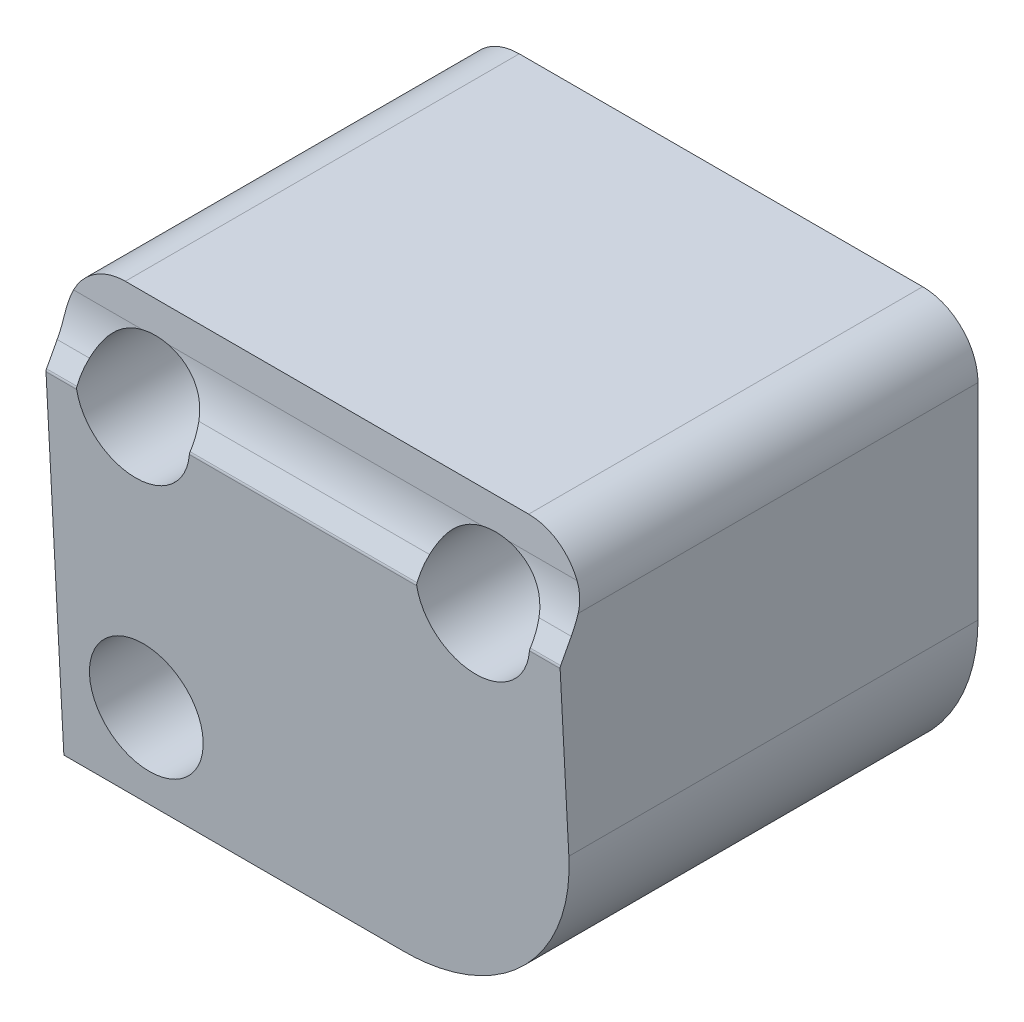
ISO-10303-21;
HEADER;
FILE_DESCRIPTION(('STEP AP214'),'2;1');
FILE_NAME('part.step','',(''),(''),'','','');
FILE_SCHEMA(('AUTOMOTIVE_DESIGN { 1 0 10303 214 1 1 1 1 }'));
ENDSEC;
DATA;
#1=APPLICATION_CONTEXT('core data for automotive mechanical design processes');
#2=APPLICATION_PROTOCOL_DEFINITION('international standard','automotive_design',2000,#1);
#3=PRODUCT_CONTEXT('',#1,'mechanical');
#4=PRODUCT('Part','Part','',(#3));
#5=PRODUCT_RELATED_PRODUCT_CATEGORY('part','',(#4));
#6=PRODUCT_DEFINITION_FORMATION('','',#4);
#7=PRODUCT_DEFINITION_CONTEXT('part definition',#1,'design');
#8=PRODUCT_DEFINITION('design','',#6,#7);
#9=PRODUCT_DEFINITION_SHAPE('','',#8);
#10=(LENGTH_UNIT() NAMED_UNIT(*) SI_UNIT(.MILLI.,.METRE.));
#11=(NAMED_UNIT(*) PLANE_ANGLE_UNIT() SI_UNIT($,.RADIAN.));
#12=(NAMED_UNIT(*) SI_UNIT($,.STERADIAN.) SOLID_ANGLE_UNIT());
#13=UNCERTAINTY_MEASURE_WITH_UNIT(LENGTH_MEASURE(1.E-05),#10,'distance_accuracy_value','');
#14=(GEOMETRIC_REPRESENTATION_CONTEXT(3) GLOBAL_UNCERTAINTY_ASSIGNED_CONTEXT((#13)) GLOBAL_UNIT_ASSIGNED_CONTEXT((#10,
#11,#12)) REPRESENTATION_CONTEXT('',''));
#15=CARTESIAN_POINT('',(0.,0.,0.));
#16=DIRECTION('',(0.,0.,1.));
#17=DIRECTION('',(1.,0.,0.));
#18=AXIS2_PLACEMENT_3D('',#15,#16,#17);
#19=CARTESIAN_POINT('',(-518.026152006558,-26.6178402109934,3.175));
#20=DIRECTION('',(0.,0.,-1.));
#21=DIRECTION('',(-1.,0.,0.));
#22=AXIS2_PLACEMENT_3D('',#19,#20,#21);
#23=CYLINDRICAL_SURFACE('',#22,13.97);
#24=DIRECTION('',(0.,0.,-1.));
#25=VECTOR('',#24,1.);
#26=CARTESIAN_POINT('',(-504.056152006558,-26.6178402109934,3.175));
#27=LINE('',#26,#25);
#28=CARTESIAN_POINT('',(-504.056152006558,-26.6178402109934,1.09636257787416));
#29=VERTEX_POINT('',#28);
#30=CARTESIAN_POINT('',(-504.056152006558,-26.6178402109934,-31.75));
#31=VERTEX_POINT('',#30);
#32=EDGE_CURVE('E388',#29,#31,#27,.T.);
#33=ORIENTED_EDGE('',*,*,#32,.F.);
#34=CARTESIAN_POINT('',(-518.026152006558,-26.6178402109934,1.09636257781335));
#35=DIRECTION('',(4.34757250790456E-12,0.052335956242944,-0.998629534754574));
#36=DIRECTION('',(-8.29566252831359E-11,-0.998629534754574,-0.052335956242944));
#37=AXIS2_PLACEMENT_3D('',#34,#35,#36);
#38=ELLIPSE('',#37,13.989171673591,13.97);
#39=CARTESIAN_POINT('',(-518.026152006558,-40.5878402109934,0.364225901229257));
#40=VERTEX_POINT('',#39);
#41=EDGE_CURVE('E389',#29,#40,#38,.T.);
#42=ORIENTED_EDGE('',*,*,#41,.T.);
#43=DIRECTION('',(0.,0.,-1.));
#44=VECTOR('',#43,1.);
#45=CARTESIAN_POINT('',(-518.026152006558,-40.5878402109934,3.175));
#46=LINE('',#45,#44);
#47=CARTESIAN_POINT('',(-518.026152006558,-40.5878402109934,-31.75));
#48=VERTEX_POINT('',#47);
#49=EDGE_CURVE('E416',#40,#48,#46,.T.);
#50=ORIENTED_EDGE('',*,*,#49,.T.);
#51=CARTESIAN_POINT('',(-518.026152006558,-26.6178402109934,-31.75));
#52=DIRECTION('',(0.,0.,1.));
#53=DIRECTION('',(-1.,0.,0.));
#54=AXIS2_PLACEMENT_3D('',#51,#52,#53);
#55=CIRCLE('',#54,13.97);
#56=EDGE_CURVE('E392',#48,#31,#55,.T.);
#57=ORIENTED_EDGE('',*,*,#56,.T.);
#58=EDGE_LOOP('',(#33,#42,#50,#57));
#59=FACE_BOUND('',#58,.T.);
#60=ADVANCED_FACE('F50',(#59),#23,.T.);
#61=CARTESIAN_POINT('',(-504.056152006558,-10.1078402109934,3.175));
#62=DIRECTION('',(-1.,0.,0.));
#63=DIRECTION('',(0.,0.,1.));
#64=AXIS2_PLACEMENT_3D('',#61,#62,#63);
#65=PLANE('',#64);
#66=CARTESIAN_POINT('',(-504.056152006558,-13.1991941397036,1.43839470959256));
#67=DIRECTION('',(-1.,0.,0.));
#68=DIRECTION('',(0.,0.,1.));
#69=AXIS2_PLACEMENT_3D('',#66,#67,#68);
#70=CIRCLE('',#69,0.360714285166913);
#71=CARTESIAN_POINT('',(-504.056152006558,-13.0298490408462,1.75688651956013));
#72=VERTEX_POINT('',#71);
#73=CARTESIAN_POINT('',(-504.056152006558,-13.2180724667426,1.79861464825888));
#74=VERTEX_POINT('',#73);
#75=EDGE_CURVE('E510',#72,#74,#70,.F.);
#76=ORIENTED_EDGE('',*,*,#75,.T.);
#77=DIRECTION('',(0.,-0.998629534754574,-0.052335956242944));
#78=VECTOR('',#77,1.);
#79=CARTESIAN_POINT('',(-504.056152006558,-10.0444235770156,1.96493853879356));
#80=LINE('',#79,#78);
#81=EDGE_CURVE('E492',#74,#29,#80,.T.);
#82=ORIENTED_EDGE('',*,*,#81,.T.);
#83=ORIENTED_EDGE('',*,*,#32,.T.);
#84=DIRECTION('',(0.,1.,0.));
#85=VECTOR('',#84,1.);
#86=CARTESIAN_POINT('',(-504.056152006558,-10.1078402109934,-31.75));
#87=LINE('',#86,#85);
#88=CARTESIAN_POINT('',(-504.056152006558,-10.1078402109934,-31.75));
#89=VERTEX_POINT('',#88);
#90=EDGE_CURVE('E438',#31,#89,#87,.T.);
#91=ORIENTED_EDGE('',*,*,#90,.T.);
#92=DIRECTION('',(0.,0.,-1.));
#93=VECTOR('',#92,1.);
#94=CARTESIAN_POINT('',(-504.056152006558,-10.1078402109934,3.175));
#95=LINE('',#94,#93);
#96=CARTESIAN_POINT('',(-504.056152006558,-10.1078402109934,0.35244700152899));
#97=VERTEX_POINT('',#96);
#98=EDGE_CURVE('E398',#97,#89,#95,.T.);
#99=ORIENTED_EDGE('',*,*,#98,.F.);
#100=CARTESIAN_POINT('',(-504.056152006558,-7.80350816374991,7.70919328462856));
#101=DIRECTION('',(-1.,0.,0.));
#102=DIRECTION('',(0.,0.,1.));
#103=AXIS2_PLACEMENT_3D('',#100,#101,#102);
#104=CIRCLE('',#103,7.70919334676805);
#105=CARTESIAN_POINT('',(-504.056152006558,-11.422755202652,0.902379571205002));
#106=VERTEX_POINT('',#105);
#107=EDGE_CURVE('E217',#97,#106,#104,.T.);
#108=ORIENTED_EDGE('',*,*,#107,.T.);
#109=DIRECTION('',(0.,-0.882947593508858,0.469471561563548));
#110=VECTOR('',#109,1.);
#111=CARTESIAN_POINT('',(-504.056152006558,-11.3396959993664,0.858216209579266));
#112=LINE('',#111,#110);
#113=EDGE_CURVE('E310',#106,#72,#112,.T.);
#114=ORIENTED_EDGE('',*,*,#113,.T.);
#115=EDGE_LOOP('',(#76,#82,#83,#91,#99,#108,#114));
#116=FACE_BOUND('',#115,.T.);
#117=ADVANCED_FACE('F377',(#116),#65,.F.);
#118=CARTESIAN_POINT('',(-508.501152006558,-10.1078402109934,3.175));
#119=DIRECTION('',(0.,0.,-1.));
#120=DIRECTION('',(-1.,0.,0.));
#121=AXIS2_PLACEMENT_3D('',#118,#119,#120);
#122=CYLINDRICAL_SURFACE('',#121,4.44500000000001);
#123=CARTESIAN_POINT('',(-508.501152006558,-10.1078402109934,0.11018520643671));
#124=DIRECTION('',(3.19224406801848E-12,-0.0523359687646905,-0.998629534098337));
#125=DIRECTION('',(-6.09116307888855E-11,0.998629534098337,-0.0523359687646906));
#126=AXIS2_PLACEMENT_3D('',#123,#124,#125);
#127=ELLIPSE('',#126,4.45110008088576,4.44500000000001);
#128=CARTESIAN_POINT('',(-508.501152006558,-5.6628402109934,-0.122767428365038));
#129=VERTEX_POINT('',#128);
#130=CARTESIAN_POINT('',(-504.483100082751,-8.20697626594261,0.0105651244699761));
#131=VERTEX_POINT('',#130);
#132=EDGE_CURVE('E556',#129,#131,#127,.T.);
#133=ORIENTED_EDGE('',*,*,#132,.T.);
#134=CARTESIAN_POINT('',(-504.483100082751,-8.20697626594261,0.010565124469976));
#135=CARTESIAN_POINT('',(-504.434948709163,-8.30871050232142,0.0158786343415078));
#136=CARTESIAN_POINT('',(-504.390738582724,-8.41220497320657,0.0233420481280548));
#137=CARTESIAN_POINT('',(-504.310382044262,-8.62189496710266,0.0428433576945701));
#138=CARTESIAN_POINT('',(-504.274238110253,-8.72809130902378,0.0548826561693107));
#139=CARTESIAN_POINT('',(-504.210892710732,-8.94006762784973,0.0835057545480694));
#140=CARTESIAN_POINT('',(-504.183520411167,-9.04581006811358,0.0999895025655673));
#141=CARTESIAN_POINT('',(-504.136765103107,-9.25815521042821,0.137714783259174));
#142=CARTESIAN_POINT('',(-504.11737839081,-9.36475749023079,0.158954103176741));
#143=CARTESIAN_POINT('',(-504.086624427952,-9.57734659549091,0.206066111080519));
#144=CARTESIAN_POINT('',(-504.075205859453,-9.68333291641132,0.231907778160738));
#145=CARTESIAN_POINT('',(-504.05992060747,-9.89574368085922,0.28851287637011));
#146=CARTESIAN_POINT('',(-504.056135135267,-10.002160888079,0.31932550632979));
#147=CARTESIAN_POINT('',(-504.056152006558,-10.1078402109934,0.352447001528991));
#148=B_SPLINE_CURVE_WITH_KNOTS('',3,(#134,#135,#136,#137,#138,#139,#140,#141,#142,#143,#144,
#145,#146,#147),.UNSPECIFIED.,.F.,.F.,(4,2,2,2,2,2,4),(0.,0.337947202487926,0.675998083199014,
1.00699623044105,1.33784068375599,1.66653419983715,1.99870673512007),.UNSPECIFIED.);
#149=EDGE_CURVE('E210',#131,#97,#148,.T.);
#150=ORIENTED_EDGE('',*,*,#149,.T.);
#151=ORIENTED_EDGE('',*,*,#98,.T.);
#152=CARTESIAN_POINT('',(-508.501152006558,-10.1078402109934,-31.75));
#153=DIRECTION('',(0.,0.,1.));
#154=DIRECTION('',(-1.,0.,0.));
#155=AXIS2_PLACEMENT_3D('',#152,#153,#154);
#156=CIRCLE('',#155,4.44500000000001);
#157=CARTESIAN_POINT('',(-508.501152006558,-5.66284021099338,-31.75));
#158=VERTEX_POINT('',#157);
#159=EDGE_CURVE('E434',#89,#158,#156,.T.);
#160=ORIENTED_EDGE('',*,*,#159,.T.);
#161=DIRECTION('',(0.,0.,-1.));
#162=VECTOR('',#161,1.);
#163=CARTESIAN_POINT('',(-508.501152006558,-5.66284021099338,3.175));
#164=LINE('',#163,#162);
#165=EDGE_CURVE('E403',#129,#158,#164,.T.);
#166=ORIENTED_EDGE('',*,*,#165,.F.);
#167=EDGE_LOOP('',(#133,#150,#151,#160,#166));
#168=FACE_BOUND('',#167,.T.);
#169=ADVANCED_FACE('F383',(#168),#122,.T.);
#170=CARTESIAN_POINT('',(-540.886152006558,-5.66284021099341,3.175));
#171=DIRECTION('',(0.,-1.,0.));
#172=DIRECTION('',(1.,0.,0.));
#173=AXIS2_PLACEMENT_3D('',#170,#171,#172);
#174=PLANE('',#173);
#175=DIRECTION('',(0.,0.,-1.));
#176=VECTOR('',#175,1.);
#177=CARTESIAN_POINT('',(-540.886152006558,-5.66284021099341,3.175));
#178=LINE('',#177,#176);
#179=CARTESIAN_POINT('',(-540.886152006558,-5.66284021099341,-0.12276742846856));
#180=VERTEX_POINT('',#179);
#181=CARTESIAN_POINT('',(-540.886152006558,-5.66284021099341,-31.75));
#182=VERTEX_POINT('',#181);
#183=EDGE_CURVE('E408',#180,#182,#178,.T.);
#184=ORIENTED_EDGE('',*,*,#183,.F.);
#185=DIRECTION('',(1.,0.,3.19661089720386E-12));
#186=VECTOR('',#185,1.);
#187=CARTESIAN_POINT('',(-540.886152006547,-5.66284021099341,-0.12276742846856));
#188=LINE('',#187,#186);
#189=EDGE_CURVE('E186',#180,#129,#188,.T.);
#190=ORIENTED_EDGE('',*,*,#189,.T.);
#191=ORIENTED_EDGE('',*,*,#165,.T.);
#192=DIRECTION('',(-1.,0.,0.));
#193=VECTOR('',#192,1.);
#194=CARTESIAN_POINT('',(-540.886152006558,-5.66284021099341,-31.75));
#195=LINE('',#194,#193);
#196=EDGE_CURVE('E430',#158,#182,#195,.T.);
#197=ORIENTED_EDGE('',*,*,#196,.T.);
#198=EDGE_LOOP('',(#184,#190,#191,#197));
#199=FACE_BOUND('',#198,.T.);
#200=ADVANCED_FACE('F611',(#199),#174,.F.);
#201=CARTESIAN_POINT('',(-540.886152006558,-10.1078402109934,3.175));
#202=DIRECTION('',(0.,0.,-1.));
#203=DIRECTION('',(-1.,0.,0.));
#204=AXIS2_PLACEMENT_3D('',#201,#202,#203);
#205=CYLINDRICAL_SURFACE('',#204,4.44500000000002);
#206=DIRECTION('',(0.,0.,-1.));
#207=VECTOR('',#206,1.);
#208=CARTESIAN_POINT('',(-545.331152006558,-10.1078402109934,3.175));
#209=LINE('',#208,#207);
#210=CARTESIAN_POINT('',(-545.331152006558,-10.1078402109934,0.352447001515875));
#211=VERTEX_POINT('',#210);
#212=CARTESIAN_POINT('',(-545.331152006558,-10.1078402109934,-31.75));
#213=VERTEX_POINT('',#212);
#214=EDGE_CURVE('E208',#211,#213,#209,.T.);
#215=ORIENTED_EDGE('',*,*,#214,.F.);
#216=CARTESIAN_POINT('',(-545.331152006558,-10.1078402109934,0.352447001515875));
#217=CARTESIAN_POINT('',(-545.331170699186,-10.0003218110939,0.318747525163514));
#218=CARTESIAN_POINT('',(-545.327251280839,-9.8920362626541,0.287439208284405));
#219=CARTESIAN_POINT('',(-545.311335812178,-9.6747032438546,0.229697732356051));
#220=CARTESIAN_POINT('',(-545.299335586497,-9.56565540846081,0.203267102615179));
#221=CARTESIAN_POINT('',(-545.267397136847,-9.34997554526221,0.155912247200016));
#222=CARTESIAN_POINT('',(-545.247631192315,-9.24334094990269,0.134883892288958));
#223=CARTESIAN_POINT('',(-545.200132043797,-9.03107512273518,0.0976004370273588));
#224=CARTESIAN_POINT('',(-545.172403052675,-8.92544339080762,0.0813428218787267));
#225=CARTESIAN_POINT('',(-545.109238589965,-8.71666484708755,0.0535542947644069));
#226=CARTESIAN_POINT('',(-545.073856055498,-8.61350612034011,0.041992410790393));
#227=CARTESIAN_POINT('',(-544.99504003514,-8.408639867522,0.0230864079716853));
#228=CARTESIAN_POINT('',(-544.951524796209,-8.30695950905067,0.0157885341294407));
#229=CARTESIAN_POINT('',(-544.904203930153,-8.20697626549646,0.0105651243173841));
#230=B_SPLINE_CURVE_WITH_KNOTS('',3,(#216,#217,#218,#219,#220,#221,#222,#223,#224,#225,#226,
#227,#228,#229),.UNSPECIFIED.,.F.,.F.,(4,2,2,2,2,2,4),(0.,0.337957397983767,0.676089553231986,
1.00710934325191,1.33795432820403,1.66658023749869,1.99870707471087),.UNSPECIFIED.);
#231=CARTESIAN_POINT('',(-544.904203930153,-8.20697626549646,0.0105651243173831));
#232=VERTEX_POINT('',#231);
#233=EDGE_CURVE('E195',#211,#232,#230,.T.);
#234=ORIENTED_EDGE('',*,*,#233,.T.);
#235=CARTESIAN_POINT('',(-540.886152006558,-10.1078402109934,0.110185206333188));
#236=DIRECTION('',(3.19224406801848E-12,-0.0523359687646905,-0.998629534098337));
#237=DIRECTION('',(-6.09116307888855E-11,0.998629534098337,-0.0523359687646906));
#238=AXIS2_PLACEMENT_3D('',#235,#236,#237);
#239=ELLIPSE('',#238,4.45110008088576,4.44500000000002);
#240=EDGE_CURVE('E180',#232,#180,#239,.T.);
#241=ORIENTED_EDGE('',*,*,#240,.T.);
#242=ORIENTED_EDGE('',*,*,#183,.T.);
#243=CARTESIAN_POINT('',(-540.886152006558,-10.1078402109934,-31.75));
#244=DIRECTION('',(0.,0.,1.));
#245=DIRECTION('',(-1.,0.,0.));
#246=AXIS2_PLACEMENT_3D('',#243,#244,#245);
#247=CIRCLE('',#246,4.44500000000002);
#248=EDGE_CURVE('E427',#182,#213,#247,.T.);
#249=ORIENTED_EDGE('',*,*,#248,.T.);
#250=EDGE_LOOP('',(#215,#234,#241,#242,#249));
#251=FACE_BOUND('',#250,.T.);
#252=ADVANCED_FACE('F206',(#251),#205,.T.);
#253=CARTESIAN_POINT('',(-545.331152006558,-10.1078402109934,3.175));
#254=DIRECTION('',(1.,0.,0.));
#255=DIRECTION('',(0.,0.,-1.));
#256=AXIS2_PLACEMENT_3D('',#253,#254,#255);
#257=PLANE('',#256);
#258=DIRECTION('',(0.,0.,-1.));
#259=VECTOR('',#258,1.);
#260=CARTESIAN_POINT('',(-545.331152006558,-40.5878402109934,3.175));
#261=LINE('',#260,#259);
#262=CARTESIAN_POINT('',(-545.331152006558,-40.5878402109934,0.36422590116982));
#263=VERTEX_POINT('',#262);
#264=CARTESIAN_POINT('',(-545.331152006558,-40.5878402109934,-31.75));
#265=VERTEX_POINT('',#264);
#266=EDGE_CURVE('E413',#263,#265,#261,.T.);
#267=ORIENTED_EDGE('',*,*,#266,.F.);
#268=DIRECTION('',(0.,0.998629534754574,0.052335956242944));
#269=VECTOR('',#268,1.);
#270=CARTESIAN_POINT('',(-545.331152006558,-10.0444235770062,1.96493853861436));
#271=LINE('',#270,#269);
#272=CARTESIAN_POINT('',(-545.331152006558,-13.218072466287,1.79861464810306));
#273=VERTEX_POINT('',#272);
#274=EDGE_CURVE('E65',#263,#273,#271,.T.);
#275=ORIENTED_EDGE('',*,*,#274,.T.);
#276=CARTESIAN_POINT('',(-545.331152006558,-13.1991941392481,1.43839470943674));
#277=DIRECTION('',(1.,0.,0.));
#278=DIRECTION('',(0.,0.,-1.));
#279=AXIS2_PLACEMENT_3D('',#276,#277,#278);
#280=CIRCLE('',#279,0.360714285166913);
#281=CARTESIAN_POINT('',(-545.331152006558,-13.0298490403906,1.75688651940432));
#282=VERTEX_POINT('',#281);
#283=EDGE_CURVE('E513',#273,#282,#280,.F.);
#284=ORIENTED_EDGE('',*,*,#283,.T.);
#285=DIRECTION('',(0.,0.882947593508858,-0.469471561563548));
#286=VECTOR('',#285,1.);
#287=CARTESIAN_POINT('',(-545.331152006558,-11.3396959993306,0.858216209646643));
#288=LINE('',#287,#286);
#289=CARTESIAN_POINT('',(-545.331152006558,-11.4227552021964,0.902379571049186));
#290=VERTEX_POINT('',#289);
#291=EDGE_CURVE('E599',#282,#290,#288,.T.);
#292=ORIENTED_EDGE('',*,*,#291,.T.);
#293=CARTESIAN_POINT('',(-545.331152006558,-7.80350816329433,7.70919328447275));
#294=DIRECTION('',(1.,0.,0.));
#295=DIRECTION('',(0.,0.,-1.));
#296=AXIS2_PLACEMENT_3D('',#293,#294,#295);
#297=CIRCLE('',#296,7.70919334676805);
#298=EDGE_CURVE('E211',#290,#211,#297,.T.);
#299=ORIENTED_EDGE('',*,*,#298,.T.);
#300=ORIENTED_EDGE('',*,*,#214,.T.);
#301=DIRECTION('',(0.,-1.,0.));
#302=VECTOR('',#301,1.);
#303=CARTESIAN_POINT('',(-545.331152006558,-10.1078402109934,-31.75));
#304=LINE('',#303,#302);
#305=EDGE_CURVE('E423',#213,#265,#304,.T.);
#306=ORIENTED_EDGE('',*,*,#305,.T.);
#307=EDGE_LOOP('',(#267,#275,#284,#292,#299,#300,#306));
#308=FACE_BOUND('',#307,.T.);
#309=ADVANCED_FACE('F614',(#308),#257,.F.);
#310=CARTESIAN_POINT('',(-545.331152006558,-40.5878402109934,3.175));
#311=DIRECTION('',(0.,1.,0.));
#312=DIRECTION('',(-1.,0.,0.));
#313=AXIS2_PLACEMENT_3D('',#310,#311,#312);
#314=PLANE('',#313);
#315=ORIENTED_EDGE('',*,*,#49,.F.);
#316=DIRECTION('',(-1.,0.,-4.35355219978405E-12));
#317=VECTOR('',#316,1.);
#318=CARTESIAN_POINT('',(-545.331152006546,-40.5878402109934,0.364225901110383));
#319=LINE('',#318,#317);
#320=EDGE_CURVE('E499',#40,#263,#319,.T.);
#321=ORIENTED_EDGE('',*,*,#320,.T.);
#322=ORIENTED_EDGE('',*,*,#266,.T.);
#323=DIRECTION('',(1.,0.,0.));
#324=VECTOR('',#323,1.);
#325=CARTESIAN_POINT('',(-545.331152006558,-40.5878402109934,-31.75));
#326=LINE('',#325,#324);
#327=EDGE_CURVE('E419',#265,#48,#326,.T.);
#328=ORIENTED_EDGE('',*,*,#327,.T.);
#329=EDGE_LOOP('',(#315,#321,#322,#328));
#330=FACE_BOUND('',#329,.T.);
#331=ADVANCED_FACE('F723',(#330),#314,.F.);
#332=CARTESIAN_POINT('',(-518.026152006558,-26.6178402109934,-31.75));
#333=DIRECTION('',(0.,0.,-1.));
#334=DIRECTION('',(-1.,0.,0.));
#335=AXIS2_PLACEMENT_3D('',#332,#333,#334);
#336=PLANE('',#335);
#337=CARTESIAN_POINT('',(-538.346152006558,-12.6478402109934,-31.75));
#338=DIRECTION('',(0.,0.,1.));
#339=DIRECTION('',(1.,0.,0.));
#340=AXIS2_PLACEMENT_3D('',#337,#338,#339);
#341=CIRCLE('',#340,2.80669999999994);
#342=CARTESIAN_POINT('',(-535.539452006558,-12.6478402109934,-31.75));
#343=VERTEX_POINT('',#342);
#344=EDGE_CURVE('E487',#343,#343,#341,.T.);
#345=ORIENTED_EDGE('',*,*,#344,.T.);
#346=EDGE_LOOP('',(#345));
#347=FACE_BOUND('',#346,.T.);
#348=CARTESIAN_POINT('',(-538.346152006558,-33.6028402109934,-31.75));
#349=DIRECTION('',(0.,0.,1.));
#350=DIRECTION('',(1.,0.,0.));
#351=AXIS2_PLACEMENT_3D('',#348,#349,#350);
#352=CIRCLE('',#351,2.80669999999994);
#353=CARTESIAN_POINT('',(-535.539452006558,-33.6028402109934,-31.75));
#354=VERTEX_POINT('',#353);
#355=EDGE_CURVE('E472',#354,#354,#352,.T.);
#356=ORIENTED_EDGE('',*,*,#355,.T.);
#357=EDGE_LOOP('',(#356));
#358=FACE_BOUND('',#357,.T.);
#359=CARTESIAN_POINT('',(-511.041152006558,-12.6478402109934,-31.75));
#360=DIRECTION('',(0.,0.,1.));
#361=DIRECTION('',(1.,0.,0.));
#362=AXIS2_PLACEMENT_3D('',#359,#360,#361);
#363=CIRCLE('',#362,2.80669999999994);
#364=CARTESIAN_POINT('',(-508.234452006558,-12.6478402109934,-31.75));
#365=VERTEX_POINT('',#364);
#366=EDGE_CURVE('E456',#365,#365,#363,.T.);
#367=ORIENTED_EDGE('',*,*,#366,.T.);
#368=EDGE_LOOP('',(#367));
#369=FACE_BOUND('',#368,.T.);
#370=ORIENTED_EDGE('',*,*,#56,.F.);
#371=ORIENTED_EDGE('',*,*,#327,.F.);
#372=ORIENTED_EDGE('',*,*,#305,.F.);
#373=ORIENTED_EDGE('',*,*,#248,.F.);
#374=ORIENTED_EDGE('',*,*,#196,.F.);
#375=ORIENTED_EDGE('',*,*,#159,.F.);
#376=ORIENTED_EDGE('',*,*,#90,.F.);
#377=EDGE_LOOP('',(#370,#371,#372,#373,#374,#375,#376));
#378=FACE_BOUND('',#377,.T.);
#379=ADVANCED_FACE('F291',(#347,#358,#369,#378),#336,.T.);
#380=CARTESIAN_POINT('',(-511.041152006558,-12.6478402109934,3.175));
#381=DIRECTION('',(0.,0.,1.));
#382=DIRECTION('',(1.,0.,0.));
#383=AXIS2_PLACEMENT_3D('',#380,#381,#382);
#384=CYLINDRICAL_SURFACE('',#383,4.55930000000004);
#385=CARTESIAN_POINT('',(-515.584420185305,-13.0298490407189,1.75688651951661));
#386=CARTESIAN_POINT('',(-515.582898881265,-13.0480031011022,1.76656374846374));
#387=CARTESIAN_POINT('',(-515.581187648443,-13.0669943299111,1.77464538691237));
#388=CARTESIAN_POINT('',(-515.577452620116,-13.1056050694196,1.78732938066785));
#389=CARTESIAN_POINT('',(-515.575436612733,-13.1252012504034,1.79200504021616));
#390=CARTESIAN_POINT('',(-515.571946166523,-13.1570246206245,1.79684253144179));
#391=CARTESIAN_POINT('',(-515.570571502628,-13.169111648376,1.79805713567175));
#392=CARTESIAN_POINT('',(-515.567698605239,-13.1935008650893,1.79927326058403));
#393=CARTESIAN_POINT('',(-515.566198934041,-13.2058037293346,1.79925789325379));
#394=CARTESIAN_POINT('',(-515.564651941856,-13.2180724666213,1.79861464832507));
#395=B_SPLINE_CURVE_WITH_KNOTS('',3,(#385,#386,#387,#388,#389,#390,#391,#392,#393,#394),
.UNSPECIFIED.,.F.,.F.,(4,2,2,2,4),(0.,0.0618200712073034,0.122266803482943,0.158886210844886,
0.19600850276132),.UNSPECIFIED.);
#396=CARTESIAN_POINT('',(-515.584420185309,-13.0298490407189,1.75688651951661));
#397=VERTEX_POINT('',#396);
#398=CARTESIAN_POINT('',(-515.564651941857,-13.2180724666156,1.79861464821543));
#399=VERTEX_POINT('',#398);
#400=EDGE_CURVE('E300',#397,#399,#395,.T.);
#401=ORIENTED_EDGE('',*,*,#400,.T.);
#402=CARTESIAN_POINT('',(-511.041152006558,-12.6478402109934,1.82849925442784));
#403=DIRECTION('',(4.34757250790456E-12,0.052335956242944,-0.998629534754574));
#404=DIRECTION('',(8.29566252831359E-11,0.998629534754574,0.052335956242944));
#405=AXIS2_PLACEMENT_3D('',#402,#403,#404);
#406=ELLIPSE('',#405,4.56555693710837,4.55930000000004);
#407=CARTESIAN_POINT('',(-506.517652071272,-13.2180724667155,1.79861464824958));
#408=VERTEX_POINT('',#407);
#409=EDGE_CURVE('E502',#399,#408,#406,.F.);
#410=ORIENTED_EDGE('',*,*,#409,.T.);
#411=CARTESIAN_POINT('',(-506.517652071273,-13.2180724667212,1.79861464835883));
#412=CARTESIAN_POINT('',(-506.515070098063,-13.1976368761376,1.79970719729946));
#413=CARTESIAN_POINT('',(-506.512625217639,-13.1770807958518,1.7990200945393));
#414=CARTESIAN_POINT('',(-506.508104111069,-13.1367995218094,1.79423145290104));
#415=CARTESIAN_POINT('',(-506.506020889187,-13.1170660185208,1.79020627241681));
#416=CARTESIAN_POINT('',(-506.502952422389,-13.0861335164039,1.78114930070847));
#417=CARTESIAN_POINT('',(-506.501858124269,-13.0746373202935,1.77714018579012));
#418=CARTESIAN_POINT('',(-506.49978119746,-13.0519430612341,1.7679154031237));
#419=CARTESIAN_POINT('',(-506.498800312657,-13.0407512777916,1.76268389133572));
#420=CARTESIAN_POINT('',(-506.49788382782,-13.029849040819,1.75688651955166));
#421=B_SPLINE_CURVE_WITH_KNOTS('',3,(#411,#412,#413,#414,#415,#416,#417,#418,#419,#420),
.UNSPECIFIED.,.F.,.F.,(4,2,2,2,4),(0.,0.0618261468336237,0.122275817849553,0.158890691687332,
0.196009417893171),.UNSPECIFIED.);
#422=CARTESIAN_POINT('',(-506.497883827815,-13.0298490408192,1.75688651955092));
#423=VERTEX_POINT('',#422);
#424=EDGE_CURVE('E309',#408,#423,#421,.T.);
#425=ORIENTED_EDGE('',*,*,#424,.T.);
#426=CARTESIAN_POINT('',(-511.041152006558,-12.6478402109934,1.55376882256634));
#427=DIRECTION('',(-1.84864692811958E-12,-0.469471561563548,-0.882947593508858));
#428=DIRECTION('',(-3.47679921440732E-12,-0.882947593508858,0.469471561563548));
#429=AXIS2_PLACEMENT_3D('',#426,#427,#428);
#430=ELLIPSE('',#429,5.16372662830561,4.55930000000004);
#431=CARTESIAN_POINT('',(-506.649525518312,-11.4227552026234,0.902379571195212));
#432=VERTEX_POINT('',#431);
#433=EDGE_CURVE('E525',#423,#432,#430,.F.);
#434=ORIENTED_EDGE('',*,*,#433,.T.);
#435=CARTESIAN_POINT('',(-506.649525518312,-11.4227552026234,0.902379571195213));
#436=CARTESIAN_POINT('',(-506.677864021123,-11.3210875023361,0.848296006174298));
#437=CARTESIAN_POINT('',(-506.710160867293,-11.2190304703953,0.796978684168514));
#438=CARTESIAN_POINT('',(-506.782851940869,-11.0151237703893,0.699924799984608));
#439=CARTESIAN_POINT('',(-506.823247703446,-10.9132741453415,0.654189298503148));
#440=CARTESIAN_POINT('',(-506.912210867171,-10.711025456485,0.568460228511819));
#441=CARTESIAN_POINT('',(-506.960760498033,-10.6106237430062,0.528454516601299));
#442=CARTESIAN_POINT('',(-507.066061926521,-10.4121089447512,0.453981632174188));
#443=CARTESIAN_POINT('',(-507.122812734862,-10.3139955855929,0.419513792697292));
#444=CARTESIAN_POINT('',(-507.244458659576,-10.1209094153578,0.355849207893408));
#445=CARTESIAN_POINT('',(-507.309367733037,-10.0259423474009,0.32666171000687));
#446=CARTESIAN_POINT('',(-507.446966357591,-9.84027855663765,0.273296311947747));
#447=CARTESIAN_POINT('',(-507.519658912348,-9.74958350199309,0.249120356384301));
#448=CARTESIAN_POINT('',(-507.672336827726,-9.57344944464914,0.205380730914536));
#449=CARTESIAN_POINT('',(-507.752318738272,-9.48800798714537,0.185814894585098));
#450=CARTESIAN_POINT('',(-507.919113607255,-9.32310688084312,0.150781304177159));
#451=CARTESIAN_POINT('',(-508.00592905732,-9.24364943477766,0.135315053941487));
#452=CARTESIAN_POINT('',(-508.185208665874,-9.09192852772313,0.108039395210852));
#453=CARTESIAN_POINT('',(-508.277633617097,-9.01962273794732,0.0962074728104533));
#454=CARTESIAN_POINT('',(-508.468045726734,-8.88218839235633,0.075521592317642));
#455=CARTESIAN_POINT('',(-508.566035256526,-8.81706293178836,0.0666689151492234));
#456=CARTESIAN_POINT('',(-508.766847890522,-8.69453967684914,0.0514170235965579));
#457=CARTESIAN_POINT('',(-508.869668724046,-8.63713830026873,0.0450166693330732));
#458=CARTESIAN_POINT('',(-509.07952867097,-8.53042452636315,0.0341605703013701));
#459=CARTESIAN_POINT('',(-509.186568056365,-8.48111265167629,0.0297049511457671));
#460=CARTESIAN_POINT('',(-509.410963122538,-8.38810488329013,0.0220454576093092));
#461=CARTESIAN_POINT('',(-509.52854628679,-8.34494936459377,0.0189367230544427));
#462=CARTESIAN_POINT('',(-509.766604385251,-8.26852844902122,0.0139474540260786));
#463=CARTESIAN_POINT('',(-509.887071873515,-8.2352400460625,0.0120640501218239));
#464=CARTESIAN_POINT('',(-510.008706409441,-8.20697626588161,0.0105651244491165));
#465=B_SPLINE_CURVE_WITH_KNOTS('',3,(#435,#436,#437,#438,#439,#440,#441,#442,#443,#444,#445,
#446,#447,#448,#449,#450,#451,#452,#453,#454,#455,#456,#457,#458,#459,#460,#461,#462,#463,#464),
.UNSPECIFIED.,.F.,.F.,(4,2,2,2,2,2,2,2,2,2,2,2,2,2,4),(0.,0.355710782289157,0.71148905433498,
1.06650178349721,1.42147172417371,1.77705742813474,2.1327808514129,2.48833677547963,
2.84402294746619,3.19745908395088,3.5510469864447,3.90447033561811,4.25791650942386,
4.63335549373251,5.00791209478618),.UNSPECIFIED.);
#466=CARTESIAN_POINT('',(-510.008706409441,-8.20697626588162,0.0105651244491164));
#467=VERTEX_POINT('',#466);
#468=EDGE_CURVE('E269',#432,#467,#465,.T.);
#469=ORIENTED_EDGE('',*,*,#468,.T.);
#470=CARTESIAN_POINT('',(-511.041152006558,-12.6478402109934,0.243300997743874));
#471=DIRECTION('',(3.19224406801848E-12,-0.0523359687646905,-0.998629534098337));
#472=DIRECTION('',(6.09116307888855E-11,-0.998629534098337,0.0523359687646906));
#473=AXIS2_PLACEMENT_3D('',#470,#471,#472);
#474=ELLIPSE('',#473,4.56555694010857,4.55930000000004);
#475=CARTESIAN_POINT('',(-512.073597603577,-8.20697626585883,0.0105651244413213));
#476=VERTEX_POINT('',#475);
#477=EDGE_CURVE('E191',#467,#476,#474,.F.);
#478=ORIENTED_EDGE('',*,*,#477,.T.);
#479=CARTESIAN_POINT('',(-512.073597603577,-8.20697626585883,0.0105651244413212));
#480=CARTESIAN_POINT('',(-512.195450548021,-8.23529136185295,0.0120667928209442));
#481=CARTESIAN_POINT('',(-512.316128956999,-8.26864732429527,0.0139542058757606));
#482=CARTESIAN_POINT('',(-512.554327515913,-8.34515128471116,0.0189509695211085));
#483=CARTESIAN_POINT('',(-512.671847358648,-8.38830023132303,0.0220604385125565));
#484=CARTESIAN_POINT('',(-512.90306455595,-8.48416488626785,0.0299574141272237));
#485=CARTESIAN_POINT('',(-513.016756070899,-8.53689448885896,0.0347473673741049));
#486=CARTESIAN_POINT('',(-513.239320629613,-8.65147518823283,0.0465609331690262));
#487=CARTESIAN_POINT('',(-513.348193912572,-8.71332583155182,0.0535844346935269));
#488=CARTESIAN_POINT('',(-513.56050460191,-8.84576735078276,0.0704880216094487));
#489=CARTESIAN_POINT('',(-513.663932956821,-8.91637216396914,0.0803726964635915));
#490=CARTESIAN_POINT('',(-513.864386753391,-9.06563756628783,0.103643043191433));
#491=CARTESIAN_POINT('',(-513.961412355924,-9.14429795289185,0.117028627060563));
#492=CARTESIAN_POINT('',(-514.148220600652,-9.30885575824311,0.147937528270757));
#493=CARTESIAN_POINT('',(-514.238011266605,-9.39474493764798,0.16545617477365));
#494=CARTESIAN_POINT('',(-514.409790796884,-9.57297362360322,0.205261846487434));
#495=CARTESIAN_POINT('',(-514.491780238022,-9.66531265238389,0.227548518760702));
#496=CARTESIAN_POINT('',(-514.644644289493,-9.8521095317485,0.27657017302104));
#497=CARTESIAN_POINT('',(-514.715808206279,-9.94637894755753,0.303121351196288));
#498=CARTESIAN_POINT('',(-514.849921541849,-10.1390034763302,0.361591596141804));
#499=CARTESIAN_POINT('',(-514.912871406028,-10.2373583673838,0.393510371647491));
#500=CARTESIAN_POINT('',(-515.030260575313,-10.4370398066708,0.462998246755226));
#501=CARTESIAN_POINT('',(-515.084703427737,-10.5383650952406,0.500564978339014));
#502=CARTESIAN_POINT('',(-515.184980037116,-10.7428809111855,0.581512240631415));
#503=CARTESIAN_POINT('',(-515.230817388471,-10.8460706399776,0.62489033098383));
#504=CARTESIAN_POINT('',(-515.30400999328,-11.0284365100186,0.706411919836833));
#505=CARTESIAN_POINT('',(-515.333163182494,-11.1074501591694,0.74332413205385));
#506=CARTESIAN_POINT('',(-515.386579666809,-11.2653008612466,0.820406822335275));
#507=CARTESIAN_POINT('',(-515.410853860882,-11.3441379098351,0.860569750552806));
#508=CARTESIAN_POINT('',(-515.432778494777,-11.4227552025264,0.902379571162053));
#509=B_SPLINE_CURVE_WITH_KNOTS('',3,(#479,#480,#481,#482,#483,#484,#485,#486,#487,#488,#489,
#490,#491,#492,#493,#494,#495,#496,#497,#498,#499,#500,#501,#502,#503,#504,#505,#506,#507,#508),
.UNSPECIFIED.,.F.,.F.,(4,2,2,2,2,2,2,2,2,2,2,2,2,2,4),(0.,0.375221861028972,0.750480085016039,
1.12628693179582,1.50207510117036,1.87846942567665,2.25485428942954,2.63081581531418,
3.00674952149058,3.36947478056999,3.73218036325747,4.09473429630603,4.45713645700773,
4.73281811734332,5.00787692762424),.UNSPECIFIED.);
#510=CARTESIAN_POINT('',(-515.432778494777,-11.4227552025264,0.902379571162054));
#511=VERTEX_POINT('',#510);
#512=EDGE_CURVE('E219',#476,#511,#509,.T.);
#513=ORIENTED_EDGE('',*,*,#512,.T.);
#514=EDGE_CURVE('E590',#511,#397,#430,.F.);
#515=ORIENTED_EDGE('',*,*,#514,.T.);
#516=EDGE_LOOP('',(#401,#410,#425,#434,#469,#478,#513,#515));
#517=FACE_BOUND('',#516,.T.);
#518=CARTESIAN_POINT('',(-511.041152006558,-12.6478402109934,-8.763));
#519=DIRECTION('',(0.,0.,1.));
#520=DIRECTION('',(1.,0.,0.));
#521=AXIS2_PLACEMENT_3D('',#518,#519,#520);
#522=CIRCLE('',#521,4.55930000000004);
#523=CARTESIAN_POINT('',(-506.481852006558,-12.6478402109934,-8.763));
#524=VERTEX_POINT('',#523);
#525=EDGE_CURVE('E443',#524,#524,#522,.T.);
#526=ORIENTED_EDGE('',*,*,#525,.F.);
#527=EDGE_LOOP('',(#526));
#528=FACE_BOUND('',#527,.T.);
#529=ADVANCED_FACE('F285',(#517,#528),#384,.F.);
#530=CARTESIAN_POINT('',(-508.234452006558,-12.6478402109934,-8.763));
#531=DIRECTION('',(0.,0.,-1.));
#532=DIRECTION('',(-1.,0.,0.));
#533=AXIS2_PLACEMENT_3D('',#530,#531,#532);
#534=PLANE('',#533);
#535=CARTESIAN_POINT('',(-511.041152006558,-12.6478402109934,-8.763));
#536=DIRECTION('',(0.,0.,1.));
#537=DIRECTION('',(1.,0.,0.));
#538=AXIS2_PLACEMENT_3D('',#535,#536,#537);
#539=CIRCLE('',#538,2.80670000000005);
#540=CARTESIAN_POINT('',(-508.234452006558,-12.6478402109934,-8.763));
#541=VERTEX_POINT('',#540);
#542=EDGE_CURVE('E448',#541,#541,#539,.T.);
#543=ORIENTED_EDGE('',*,*,#542,.F.);
#544=EDGE_LOOP('',(#543));
#545=FACE_BOUND('',#544,.T.);
#546=ORIENTED_EDGE('',*,*,#525,.T.);
#547=EDGE_LOOP('',(#546));
#548=FACE_BOUND('',#547,.T.);
#549=ADVANCED_FACE('F290',(#545,#548),#534,.F.);
#550=CARTESIAN_POINT('',(-511.041152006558,-12.6478402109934,3.175));
#551=DIRECTION('',(0.,0.,1.));
#552=DIRECTION('',(1.,0.,0.));
#553=AXIS2_PLACEMENT_3D('',#550,#551,#552);
#554=CYLINDRICAL_SURFACE('',#553,2.8067);
#555=ORIENTED_EDGE('',*,*,#366,.F.);
#556=EDGE_LOOP('',(#555));
#557=FACE_BOUND('',#556,.T.);
#558=ORIENTED_EDGE('',*,*,#542,.T.);
#559=EDGE_LOOP('',(#558));
#560=FACE_BOUND('',#559,.T.);
#561=ADVANCED_FACE('F366',(#557,#560),#554,.F.);
#562=CARTESIAN_POINT('',(-538.346152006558,-33.6028402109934,3.175));
#563=DIRECTION('',(0.,0.,1.));
#564=DIRECTION('',(1.,0.,0.));
#565=AXIS2_PLACEMENT_3D('',#562,#563,#564);
#566=CYLINDRICAL_SURFACE('',#565,4.55930000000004);
#567=CARTESIAN_POINT('',(-538.346152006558,-33.6028402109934,0.730294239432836));
#568=DIRECTION('',(4.34757250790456E-12,0.052335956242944,-0.998629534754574));
#569=DIRECTION('',(8.29566252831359E-11,0.998629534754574,0.052335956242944));
#570=AXIS2_PLACEMENT_3D('',#567,#568,#569);
#571=ELLIPSE('',#570,4.56555693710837,4.55930000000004);
#572=CARTESIAN_POINT('',(-538.346152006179,-29.0435402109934,0.969237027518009));
#573=VERTEX_POINT('',#572);
#574=EDGE_CURVE('E506',#573,#573,#571,.F.);
#575=ORIENTED_EDGE('',*,*,#574,.T.);
#576=EDGE_LOOP('',(#575));
#577=FACE_BOUND('',#576,.T.);
#578=CARTESIAN_POINT('',(-538.346152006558,-33.6028402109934,-8.763));
#579=DIRECTION('',(0.,0.,1.));
#580=DIRECTION('',(1.,0.,0.));
#581=AXIS2_PLACEMENT_3D('',#578,#579,#580);
#582=CIRCLE('',#581,4.55930000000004);
#583=CARTESIAN_POINT('',(-533.786852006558,-33.6028402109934,-8.763));
#584=VERTEX_POINT('',#583);
#585=EDGE_CURVE('E461',#584,#584,#582,.T.);
#586=ORIENTED_EDGE('',*,*,#585,.F.);
#587=EDGE_LOOP('',(#586));
#588=FACE_BOUND('',#587,.T.);
#589=ADVANCED_FACE('F363',(#577,#588),#566,.F.);
#590=CARTESIAN_POINT('',(-535.539452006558,-33.6028402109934,-8.763));
#591=DIRECTION('',(0.,0.,-1.));
#592=DIRECTION('',(-1.,0.,0.));
#593=AXIS2_PLACEMENT_3D('',#590,#591,#592);
#594=PLANE('',#593);
#595=CARTESIAN_POINT('',(-538.346152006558,-33.6028402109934,-8.763));
#596=DIRECTION('',(0.,0.,1.));
#597=DIRECTION('',(1.,0.,0.));
#598=AXIS2_PLACEMENT_3D('',#595,#596,#597);
#599=CIRCLE('',#598,2.80670000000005);
#600=CARTESIAN_POINT('',(-535.539452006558,-33.6028402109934,-8.763));
#601=VERTEX_POINT('',#600);
#602=EDGE_CURVE('E466',#601,#601,#599,.T.);
#603=ORIENTED_EDGE('',*,*,#602,.F.);
#604=EDGE_LOOP('',(#603));
#605=FACE_BOUND('',#604,.T.);
#606=ORIENTED_EDGE('',*,*,#585,.T.);
#607=EDGE_LOOP('',(#606));
#608=FACE_BOUND('',#607,.T.);
#609=ADVANCED_FACE('F359',(#605,#608),#594,.F.);
#610=CARTESIAN_POINT('',(-538.346152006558,-33.6028402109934,3.175));
#611=DIRECTION('',(0.,0.,1.));
#612=DIRECTION('',(1.,0.,0.));
#613=AXIS2_PLACEMENT_3D('',#610,#611,#612);
#614=CYLINDRICAL_SURFACE('',#613,2.8067);
#615=ORIENTED_EDGE('',*,*,#355,.F.);
#616=EDGE_LOOP('',(#615));
#617=FACE_BOUND('',#616,.T.);
#618=ORIENTED_EDGE('',*,*,#602,.T.);
#619=EDGE_LOOP('',(#618));
#620=FACE_BOUND('',#619,.T.);
#621=ADVANCED_FACE('F352',(#617,#620),#614,.F.);
#622=CARTESIAN_POINT('',(-538.346152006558,-12.6478402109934,3.175));
#623=DIRECTION('',(0.,0.,1.));
#624=DIRECTION('',(1.,0.,0.));
#625=AXIS2_PLACEMENT_3D('',#622,#623,#624);
#626=CYLINDRICAL_SURFACE('',#625,4.55930000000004);
#627=CARTESIAN_POINT('',(-542.88942018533,-13.0298490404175,1.75688651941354));
#628=CARTESIAN_POINT('',(-542.887898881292,-13.0480031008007,1.76656374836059));
#629=CARTESIAN_POINT('',(-542.886187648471,-13.0669943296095,1.77464538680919));
#630=CARTESIAN_POINT('',(-542.882452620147,-13.1056050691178,1.78732938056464));
#631=CARTESIAN_POINT('',(-542.880436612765,-13.1252012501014,1.79200504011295));
#632=CARTESIAN_POINT('',(-542.876946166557,-13.1570246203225,1.79684253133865));
#633=CARTESIAN_POINT('',(-542.875571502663,-13.1691116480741,1.79805713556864));
#634=CARTESIAN_POINT('',(-542.872698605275,-13.1935008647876,1.79927326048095));
#635=CARTESIAN_POINT('',(-542.871198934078,-13.2058037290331,1.79925789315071));
#636=CARTESIAN_POINT('',(-542.869651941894,-13.2180724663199,1.79861464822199));
#637=B_SPLINE_CURVE_WITH_KNOTS('',3,(#627,#628,#629,#630,#631,#632,#633,#634,#635,#636),
.UNSPECIFIED.,.F.,.F.,(4,2,2,2,4),(0.,0.0618200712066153,0.122266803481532,0.158886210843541,
0.196008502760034),.UNSPECIFIED.);
#638=CARTESIAN_POINT('',(-542.889420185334,-13.0298490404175,1.75688651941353));
#639=VERTEX_POINT('',#638);
#640=CARTESIAN_POINT('',(-542.869651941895,-13.2180724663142,1.79861464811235));
#641=VERTEX_POINT('',#640);
#642=EDGE_CURVE('E331',#639,#641,#637,.T.);
#643=ORIENTED_EDGE('',*,*,#642,.T.);
#644=CARTESIAN_POINT('',(-538.346152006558,-12.6478402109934,1.82849925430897));
#645=DIRECTION('',(4.34757250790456E-12,0.052335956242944,-0.998629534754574));
#646=DIRECTION('',(8.29566252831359E-11,0.998629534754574,0.052335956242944));
#647=AXIS2_PLACEMENT_3D('',#644,#645,#646);
#648=ELLIPSE('',#647,4.56555693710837,4.55930000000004);
#649=CARTESIAN_POINT('',(-533.822652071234,-13.2180724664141,1.79861464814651));
#650=VERTEX_POINT('',#649);
#651=EDGE_CURVE('E12',#641,#650,#648,.F.);
#652=ORIENTED_EDGE('',*,*,#651,.T.);
#653=CARTESIAN_POINT('',(-533.822652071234,-13.2180724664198,1.79861464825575));
#654=CARTESIAN_POINT('',(-533.820070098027,-13.1976368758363,1.79970719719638));
#655=CARTESIAN_POINT('',(-533.817625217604,-13.1770807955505,1.79902009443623));
#656=CARTESIAN_POINT('',(-533.813104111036,-13.1367995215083,1.79423145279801));
#657=CARTESIAN_POINT('',(-533.811020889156,-13.1170660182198,1.79020627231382));
#658=CARTESIAN_POINT('',(-533.80795242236,-13.0861335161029,1.78114930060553));
#659=CARTESIAN_POINT('',(-533.806858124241,-13.0746373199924,1.77714018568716));
#660=CARTESIAN_POINT('',(-533.804781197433,-13.0519430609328,1.7679154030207));
#661=CARTESIAN_POINT('',(-533.803800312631,-13.0407512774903,1.76268389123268));
#662=CARTESIAN_POINT('',(-533.802883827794,-13.0298490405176,1.75688651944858));
#663=B_SPLINE_CURVE_WITH_KNOTS('',3,(#653,#654,#655,#656,#657,#658,#659,#660,#661,#662),
.UNSPECIFIED.,.F.,.F.,(4,2,2,2,4),(0.,0.0618261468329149,0.122275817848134,0.158890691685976,
0.19600941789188),.UNSPECIFIED.);
#664=CARTESIAN_POINT('',(-533.80288382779,-13.0298490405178,1.75688651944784));
#665=VERTEX_POINT('',#664);
#666=EDGE_CURVE('E58',#650,#665,#663,.T.);
#667=ORIENTED_EDGE('',*,*,#666,.T.);
#668=CARTESIAN_POINT('',(-538.346152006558,-12.6478402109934,1.55376882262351));
#669=DIRECTION('',(-1.84864692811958E-12,-0.469471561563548,-0.882947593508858));
#670=DIRECTION('',(-3.47679921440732E-12,-0.882947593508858,0.469471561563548));
#671=AXIS2_PLACEMENT_3D('',#668,#669,#670);
#672=ELLIPSE('',#671,5.16372662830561,4.55930000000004);
#673=CARTESIAN_POINT('',(-533.954525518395,-11.422755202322,0.902379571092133));
#674=VERTEX_POINT('',#673);
#675=EDGE_CURVE('E592',#665,#674,#672,.F.);
#676=ORIENTED_EDGE('',*,*,#675,.T.);
#677=CARTESIAN_POINT('',(-533.954525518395,-11.422755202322,0.902379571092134));
#678=CARTESIAN_POINT('',(-533.982864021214,-11.3210875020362,0.848296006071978));
#679=CARTESIAN_POINT('',(-534.015160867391,-11.2190304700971,0.796978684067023));
#680=CARTESIAN_POINT('',(-534.087851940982,-11.0151237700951,0.699924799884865));
#681=CARTESIAN_POINT('',(-534.128247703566,-10.9132741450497,0.654189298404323));
#682=CARTESIAN_POINT('',(-534.217210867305,-10.7110254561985,0.568460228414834));
#683=CARTESIAN_POINT('',(-534.265760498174,-10.6106237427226,0.528454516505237));
#684=CARTESIAN_POINT('',(-534.371061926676,-10.4121089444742,0.453981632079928));
#685=CARTESIAN_POINT('',(-534.427812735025,-10.3139955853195,0.419513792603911));
#686=CARTESIAN_POINT('',(-534.549458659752,-10.1209094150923,0.355849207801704));
#687=CARTESIAN_POINT('',(-534.61436773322,-10.0259423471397,0.326661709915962));
#688=CARTESIAN_POINT('',(-534.751966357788,-9.84027855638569,0.273296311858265));
#689=CARTESIAN_POINT('',(-534.824658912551,-9.74958350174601,0.249120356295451));
#690=CARTESIAN_POINT('',(-534.977336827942,-9.57344944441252,0.205380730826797));
#691=CARTESIAN_POINT('',(-535.057318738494,-9.48800798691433,0.185814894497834));
#692=CARTESIAN_POINT('',(-535.224113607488,-9.3231068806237,0.150781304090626));
#693=CARTESIAN_POINT('',(-535.310929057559,-9.24364943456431,0.135315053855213));
#694=CARTESIAN_POINT('',(-535.490208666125,-9.09192852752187,0.108039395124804));
#695=CARTESIAN_POINT('',(-535.582633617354,-9.01962273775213,0.0962074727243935));
#696=CARTESIAN_POINT('',(-535.773045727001,-8.88218839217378,0.0755215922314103));
#697=CARTESIAN_POINT('',(-535.871035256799,-8.81706293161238,0.0666689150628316));
#698=CARTESIAN_POINT('',(-536.071847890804,-8.69453967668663,0.0514170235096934));
#699=CARTESIAN_POINT('',(-536.174668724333,-8.63713830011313,0.0450166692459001));
#700=CARTESIAN_POINT('',(-536.384528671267,-8.53042452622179,0.0341605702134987));
#701=CARTESIAN_POINT('',(-536.491568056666,-8.48111265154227,0.0297049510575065));
#702=CARTESIAN_POINT('',(-536.715963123,-8.38810488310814,0.0220454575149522));
#703=CARTESIAN_POINT('',(-536.833546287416,-8.34494936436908,0.018936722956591));
#704=CARTESIAN_POINT('',(-537.071604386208,-8.26852844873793,0.0139474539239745));
#705=CARTESIAN_POINT('',(-537.192071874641,-8.23524004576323,0.012064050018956));
#706=CARTESIAN_POINT('',(-537.313706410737,-8.20697626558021,0.010565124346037));
#707=B_SPLINE_CURVE_WITH_KNOTS('',3,(#677,#678,#679,#680,#681,#682,#683,#684,#685,#686,#687,
#688,#689,#690,#691,#692,#693,#694,#695,#696,#697,#698,#699,#700,#701,#702,#703,#704,#705,#706),
.UNSPECIFIED.,.F.,.F.,(4,2,2,2,2,2,2,2,2,2,2,2,2,2,4),(0.,0.355710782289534,0.711489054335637,
1.0665017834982,1.42147172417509,1.7770574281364,2.13278085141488,2.48833677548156,
2.84402294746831,3.19745908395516,3.55104698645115,3.90447033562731,4.25791650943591,
4.63335549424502,5.0079120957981),.UNSPECIFIED.);
#708=CARTESIAN_POINT('',(-537.313706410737,-8.20697626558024,0.0105651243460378));
#709=VERTEX_POINT('',#708);
#710=EDGE_CURVE('E250',#674,#709,#707,.T.);
#711=ORIENTED_EDGE('',*,*,#710,.T.);
#712=CARTESIAN_POINT('',(-538.346152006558,-12.6478402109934,0.243300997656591));
#713=DIRECTION('',(3.19224406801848E-12,-0.0523359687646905,-0.998629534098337));
#714=DIRECTION('',(6.09116307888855E-11,-0.998629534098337,0.0523359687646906));
#715=AXIS2_PLACEMENT_3D('',#712,#713,#714);
#716=ELLIPSE('',#715,4.56555694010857,4.55930000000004);
#717=CARTESIAN_POINT('',(-539.378597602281,-8.20697626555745,0.0105651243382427));
#718=VERTEX_POINT('',#717);
#719=EDGE_CURVE('E397',#709,#718,#716,.F.);
#720=ORIENTED_EDGE('',*,*,#719,.T.);
#721=CARTESIAN_POINT('',(-539.378597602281,-8.20697626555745,0.0105651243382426));
#722=CARTESIAN_POINT('',(-539.500450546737,-8.2352913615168,0.0120667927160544));
#723=CARTESIAN_POINT('',(-539.621128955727,-8.26864732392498,0.0139542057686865));
#724=CARTESIAN_POINT('',(-539.85932751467,-8.34515128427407,0.0189509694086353));
#725=CARTESIAN_POINT('',(-539.976847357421,-8.38830023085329,0.0220604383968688));
#726=CARTESIAN_POINT('',(-540.208064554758,-8.48416488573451,0.0299574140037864));
#727=CARTESIAN_POINT('',(-540.321756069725,-8.53689448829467,0.0347473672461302));
#728=CARTESIAN_POINT('',(-540.544320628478,-8.65147518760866,0.046560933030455));
#729=CARTESIAN_POINT('',(-540.653193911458,-8.71332583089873,0.0535844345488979));
#730=CARTESIAN_POINT('',(-540.86550460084,-8.84576735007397,0.0704880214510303));
#731=CARTESIAN_POINT('',(-540.968932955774,-8.91637216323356,0.0803726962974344));
#732=CARTESIAN_POINT('',(-541.169386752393,-9.06563756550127,0.103643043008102));
#733=CARTESIAN_POINT('',(-541.266412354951,-9.14429795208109,0.117028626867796));
#734=CARTESIAN_POINT('',(-541.453220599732,-9.30885575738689,0.147937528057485));
#735=CARTESIAN_POINT('',(-541.543011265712,-9.39474493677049,0.165456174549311));
#736=CARTESIAN_POINT('',(-541.714790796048,-9.57297362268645,0.205261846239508));
#737=CARTESIAN_POINT('',(-541.796780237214,-9.66531265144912,0.227548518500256));
#738=CARTESIAN_POINT('',(-541.949644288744,-9.85210953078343,0.276570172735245));
#739=CARTESIAN_POINT('',(-542.02080820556,-9.94637894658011,0.303121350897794));
#740=CARTESIAN_POINT('',(-542.154921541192,-10.1390034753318,0.361591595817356));
#741=CARTESIAN_POINT('',(-542.217871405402,-10.2373583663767,0.393510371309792));
#742=CARTESIAN_POINT('',(-542.335260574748,-10.4370398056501,0.462998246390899));
#743=CARTESIAN_POINT('',(-542.389703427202,-10.5383650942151,0.500564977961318));
#744=CARTESIAN_POINT('',(-542.489980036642,-10.7428809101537,0.581512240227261));
#745=CARTESIAN_POINT('',(-542.535817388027,-10.8460706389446,0.62489033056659));
#746=CARTESIAN_POINT('',(-542.609009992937,-11.0284365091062,0.706411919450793));
#747=CARTESIAN_POINT('',(-542.638163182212,-11.1074501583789,0.743324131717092));
#748=CARTESIAN_POINT('',(-542.691579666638,-11.2653008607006,0.820406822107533));
#749=CARTESIAN_POINT('',(-542.715853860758,-11.3441379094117,0.860569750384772));
#750=CARTESIAN_POINT('',(-542.737778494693,-11.422755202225,0.902379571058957));
#751=B_SPLINE_CURVE_WITH_KNOTS('',3,(#721,#722,#723,#724,#725,#726,#727,#728,#729,#730,#731,
#732,#733,#734,#735,#736,#737,#738,#739,#740,#741,#742,#743,#744,#745,#746,#747,#748,#749,#750),
.UNSPECIFIED.,.F.,.F.,(4,2,2,2,2,2,2,2,2,2,2,2,2,2,4),(0.,0.375221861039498,0.750480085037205,
1.12628693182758,1.50207510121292,1.87846942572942,2.2548542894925,2.63081581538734,
3.00674952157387,3.36947478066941,3.73218036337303,4.09473429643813,4.45713645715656,
4.73281811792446,5.00787692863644),.UNSPECIFIED.);
#752=CARTESIAN_POINT('',(-542.737778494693,-11.4227552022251,0.902379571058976));
#753=VERTEX_POINT('',#752);
#754=EDGE_CURVE('E199',#718,#753,#751,.T.);
#755=ORIENTED_EDGE('',*,*,#754,.T.);
#756=EDGE_CURVE('E619',#753,#639,#672,.F.);
#757=ORIENTED_EDGE('',*,*,#756,.T.);
#758=EDGE_LOOP('',(#643,#652,#667,#676,#711,#720,#755,#757));
#759=FACE_BOUND('',#758,.T.);
#760=CARTESIAN_POINT('',(-538.346152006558,-12.6478402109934,-8.763));
#761=DIRECTION('',(0.,0.,1.));
#762=DIRECTION('',(1.,0.,0.));
#763=AXIS2_PLACEMENT_3D('',#760,#761,#762);
#764=CIRCLE('',#763,4.55930000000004);
#765=CARTESIAN_POINT('',(-533.786852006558,-12.6478402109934,-8.763));
#766=VERTEX_POINT('',#765);
#767=EDGE_CURVE('E477',#766,#766,#764,.T.);
#768=ORIENTED_EDGE('',*,*,#767,.F.);
#769=EDGE_LOOP('',(#768));
#770=FACE_BOUND('',#769,.T.);
#771=ADVANCED_FACE('F346',(#759,#770),#626,.F.);
#772=CARTESIAN_POINT('',(-535.539452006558,-12.6478402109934,-8.763));
#773=DIRECTION('',(0.,0.,-1.));
#774=DIRECTION('',(-1.,0.,0.));
#775=AXIS2_PLACEMENT_3D('',#772,#773,#774);
#776=PLANE('',#775);
#777=CARTESIAN_POINT('',(-538.346152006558,-12.6478402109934,-8.763));
#778=DIRECTION('',(0.,0.,1.));
#779=DIRECTION('',(1.,0.,0.));
#780=AXIS2_PLACEMENT_3D('',#777,#778,#779);
#781=CIRCLE('',#780,2.80670000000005);
#782=CARTESIAN_POINT('',(-535.539452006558,-12.6478402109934,-8.763));
#783=VERTEX_POINT('',#782);
#784=EDGE_CURVE('E481',#783,#783,#781,.T.);
#785=ORIENTED_EDGE('',*,*,#784,.F.);
#786=EDGE_LOOP('',(#785));
#787=FACE_BOUND('',#786,.T.);
#788=ORIENTED_EDGE('',*,*,#767,.T.);
#789=EDGE_LOOP('',(#788));
#790=FACE_BOUND('',#789,.T.);
#791=ADVANCED_FACE('F351',(#787,#790),#776,.F.);
#792=CARTESIAN_POINT('',(-538.346152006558,-12.6478402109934,3.175));
#793=DIRECTION('',(0.,0.,1.));
#794=DIRECTION('',(1.,0.,0.));
#795=AXIS2_PLACEMENT_3D('',#792,#793,#794);
#796=CYLINDRICAL_SURFACE('',#795,2.8067);
#797=ORIENTED_EDGE('',*,*,#344,.F.);
#798=EDGE_LOOP('',(#797));
#799=FACE_BOUND('',#798,.T.);
#800=ORIENTED_EDGE('',*,*,#784,.T.);
#801=EDGE_LOOP('',(#800));
#802=FACE_BOUND('',#801,.T.);
#803=ADVANCED_FACE('F689',(#799,#802),#796,.F.);
#804=CARTESIAN_POINT('',(-632.130551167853,-13.218072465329,1.79861464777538));
#805=DIRECTION('',(4.34757250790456E-12,0.052335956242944,-0.998629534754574));
#806=DIRECTION('',(0.,0.998629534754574,0.052335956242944));
#807=AXIS2_PLACEMENT_3D('',#804,#805,#806);
#808=PLANE('',#807);
#809=ORIENTED_EDGE('',*,*,#574,.F.);
#810=EDGE_LOOP('',(#809));
#811=FACE_BOUND('',#810,.T.);
#812=ORIENTED_EDGE('',*,*,#81,.F.);
#813=DIRECTION('',(1.,-1.10376152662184E-11,3.77508197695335E-12));
#814=VECTOR('',#813,1.);
#815=CARTESIAN_POINT('',(-632.130551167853,-13.218072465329,1.79861464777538));
#816=LINE('',#815,#814);
#817=EDGE_CURVE('E529',#408,#74,#816,.T.);
#818=ORIENTED_EDGE('',*,*,#817,.F.);
#819=ORIENTED_EDGE('',*,*,#409,.F.);
#820=EDGE_CURVE('E535',#650,#399,#816,.T.);
#821=ORIENTED_EDGE('',*,*,#820,.F.);
#822=ORIENTED_EDGE('',*,*,#651,.F.);
#823=EDGE_CURVE('E538',#273,#641,#816,.T.);
#824=ORIENTED_EDGE('',*,*,#823,.F.);
#825=ORIENTED_EDGE('',*,*,#274,.F.);
#826=ORIENTED_EDGE('',*,*,#320,.F.);
#827=ORIENTED_EDGE('',*,*,#41,.F.);
#828=EDGE_LOOP('',(#812,#818,#819,#821,#822,#824,#825,#826,#827));
#829=FACE_BOUND('',#828,.T.);
#830=ADVANCED_FACE('F324',(#811,#829),#808,.F.);
#831=CARTESIAN_POINT('',(-632.130551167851,-13.19919413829,1.43839470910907));
#832=DIRECTION('',(1.,-1.10376152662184E-11,3.77508197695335E-12));
#833=DIRECTION('',(1.10376152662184E-11,1.,0.));
#834=AXIS2_PLACEMENT_3D('',#831,#832,#833);
#835=CYLINDRICAL_SURFACE('',#834,0.360714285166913);
#836=ORIENTED_EDGE('',*,*,#75,.F.);
#837=DIRECTION('',(1.,-1.10376152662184E-11,3.77508197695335E-12));
#838=VECTOR('',#837,1.);
#839=CARTESIAN_POINT('',(-632.130551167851,-13.0298490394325,1.75688651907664));
#840=LINE('',#839,#838);
#841=EDGE_CURVE('E531',#423,#72,#840,.T.);
#842=ORIENTED_EDGE('',*,*,#841,.F.);
#843=ORIENTED_EDGE('',*,*,#424,.F.);
#844=ORIENTED_EDGE('',*,*,#817,.T.);
#845=EDGE_LOOP('',(#836,#842,#843,#844));
#846=FACE_BOUND('',#845,.T.);
#847=ADVANCED_FACE('F319',(#846),#835,.T.);
#848=ORIENTED_EDGE('',*,*,#283,.F.);
#849=ORIENTED_EDGE('',*,*,#823,.T.);
#850=ORIENTED_EDGE('',*,*,#642,.F.);
#851=EDGE_CURVE('E536',#282,#639,#840,.T.);
#852=ORIENTED_EDGE('',*,*,#851,.F.);
#853=EDGE_LOOP('',(#848,#849,#850,#852));
#854=FACE_BOUND('',#853,.T.);
#855=ADVANCED_FACE('F323',(#854),#835,.T.);
#856=ORIENTED_EDGE('',*,*,#400,.F.);
#857=EDGE_CURVE('E543',#665,#397,#840,.T.);
#858=ORIENTED_EDGE('',*,*,#857,.F.);
#859=ORIENTED_EDGE('',*,*,#666,.F.);
#860=ORIENTED_EDGE('',*,*,#820,.T.);
#861=EDGE_LOOP('',(#856,#858,#859,#860));
#862=FACE_BOUND('',#861,.T.);
#863=ADVANCED_FACE('F326',(#862),#835,.T.);
#864=CARTESIAN_POINT('',(-632.130551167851,-13.0298490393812,1.75688651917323));
#865=DIRECTION('',(-1.84864692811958E-12,-0.469471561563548,-0.882947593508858));
#866=DIRECTION('',(0.,0.882947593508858,-0.469471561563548));
#867=AXIS2_PLACEMENT_3D('',#864,#865,#866);
#868=PLANE('',#867);
#869=ORIENTED_EDGE('',*,*,#113,.F.);
#870=DIRECTION('',(1.,-1.10376152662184E-11,3.77508197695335E-12));
#871=VECTOR('',#870,1.);
#872=CARTESIAN_POINT('',(-632.13055116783,-11.4227552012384,0.902379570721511));
#873=LINE('',#872,#871);
#874=EDGE_CURVE('E202',#432,#106,#873,.T.);
#875=ORIENTED_EDGE('',*,*,#874,.F.);
#876=ORIENTED_EDGE('',*,*,#433,.F.);
#877=ORIENTED_EDGE('',*,*,#841,.T.);
#878=EDGE_LOOP('',(#869,#875,#876,#877));
#879=FACE_BOUND('',#878,.T.);
#880=ADVANCED_FACE('F245',(#879),#868,.F.);
#881=ORIENTED_EDGE('',*,*,#291,.F.);
#882=ORIENTED_EDGE('',*,*,#851,.T.);
#883=ORIENTED_EDGE('',*,*,#756,.F.);
#884=EDGE_CURVE('E574',#290,#753,#873,.T.);
#885=ORIENTED_EDGE('',*,*,#884,.F.);
#886=EDGE_LOOP('',(#881,#882,#883,#885));
#887=FACE_BOUND('',#886,.T.);
#888=ADVANCED_FACE('F616',(#887),#868,.F.);
#889=ORIENTED_EDGE('',*,*,#514,.F.);
#890=EDGE_CURVE('E572',#674,#511,#873,.T.);
#891=ORIENTED_EDGE('',*,*,#890,.F.);
#892=ORIENTED_EDGE('',*,*,#675,.F.);
#893=ORIENTED_EDGE('',*,*,#857,.T.);
#894=EDGE_LOOP('',(#889,#891,#892,#893));
#895=FACE_BOUND('',#894,.T.);
#896=ADVANCED_FACE('F242',(#895),#868,.F.);
#897=CARTESIAN_POINT('',(-632.130551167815,-7.80350816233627,7.70919328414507));
#898=DIRECTION('',(1.,-1.10376152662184E-11,3.77508197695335E-12));
#899=DIRECTION('',(1.10376152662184E-11,1.,0.));
#900=AXIS2_PLACEMENT_3D('',#897,#898,#899);
#901=CYLINDRICAL_SURFACE('',#900,7.70919334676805);
#902=ORIENTED_EDGE('',*,*,#107,.F.);
#903=ORIENTED_EDGE('',*,*,#149,.F.);
#904=DIRECTION('',(1.,-1.10376152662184E-11,3.77508197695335E-12));
#905=VECTOR('',#904,1.);
#906=CARTESIAN_POINT('',(-632.130551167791,-8.20697626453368,0.0105651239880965));
#907=LINE('',#906,#905);
#908=EDGE_CURVE('E204',#467,#131,#907,.T.);
#909=ORIENTED_EDGE('',*,*,#908,.F.);
#910=ORIENTED_EDGE('',*,*,#468,.F.);
#911=ORIENTED_EDGE('',*,*,#874,.T.);
#912=EDGE_LOOP('',(#902,#903,#909,#910,#911));
#913=FACE_BOUND('',#912,.T.);
#914=ADVANCED_FACE('F237',(#913),#901,.F.);
#915=ORIENTED_EDGE('',*,*,#233,.F.);
#916=ORIENTED_EDGE('',*,*,#298,.F.);
#917=ORIENTED_EDGE('',*,*,#884,.T.);
#918=ORIENTED_EDGE('',*,*,#754,.F.);
#919=EDGE_CURVE('E183',#232,#718,#907,.T.);
#920=ORIENTED_EDGE('',*,*,#919,.F.);
#921=EDGE_LOOP('',(#915,#916,#917,#918,#920));
#922=FACE_BOUND('',#921,.T.);
#923=ADVANCED_FACE('F194',(#922),#901,.F.);
#924=ORIENTED_EDGE('',*,*,#512,.F.);
#925=EDGE_CURVE('E73',#709,#476,#907,.T.);
#926=ORIENTED_EDGE('',*,*,#925,.F.);
#927=ORIENTED_EDGE('',*,*,#710,.F.);
#928=ORIENTED_EDGE('',*,*,#890,.T.);
#929=EDGE_LOOP('',(#924,#926,#927,#928));
#930=FACE_BOUND('',#929,.T.);
#931=ADVANCED_FACE('F244',(#930),#901,.F.);
#932=CARTESIAN_POINT('',(-632.130551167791,-8.20697626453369,0.0105651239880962));
#933=DIRECTION('',(3.19224406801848E-12,-0.0523359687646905,-0.998629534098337));
#934=DIRECTION('',(0.,0.998629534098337,-0.0523359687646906));
#935=AXIS2_PLACEMENT_3D('',#932,#933,#934);
#936=PLANE('',#935);
#937=ORIENTED_EDGE('',*,*,#132,.F.);
#938=ORIENTED_EDGE('',*,*,#189,.F.);
#939=ORIENTED_EDGE('',*,*,#240,.F.);
#940=ORIENTED_EDGE('',*,*,#919,.T.);
#941=ORIENTED_EDGE('',*,*,#719,.F.);
#942=ORIENTED_EDGE('',*,*,#925,.T.);
#943=ORIENTED_EDGE('',*,*,#477,.F.);
#944=ORIENTED_EDGE('',*,*,#908,.T.);
#945=EDGE_LOOP('',(#937,#938,#939,#940,#941,#942,#943,#944));
#946=FACE_BOUND('',#945,.T.);
#947=ADVANCED_FACE('F182',(#946),#936,.F.);
#948=CLOSED_SHELL('',(#60,#117,#169,#200,#252,#309,#331,#379,#529,#549,#561,#589,#609,#621,#771,
#791,#803,#830,#847,#855,#863,#880,#888,#896,#914,#923,#931,#947));
#949=MANIFOLD_SOLID_BREP('B2',#948);
#950=ADVANCED_BREP_SHAPE_REPRESENTATION('',(#18,#949),#14);
#951=SHAPE_DEFINITION_REPRESENTATION(#9,#950);
ENDSEC;
END-ISO-10303-21;
